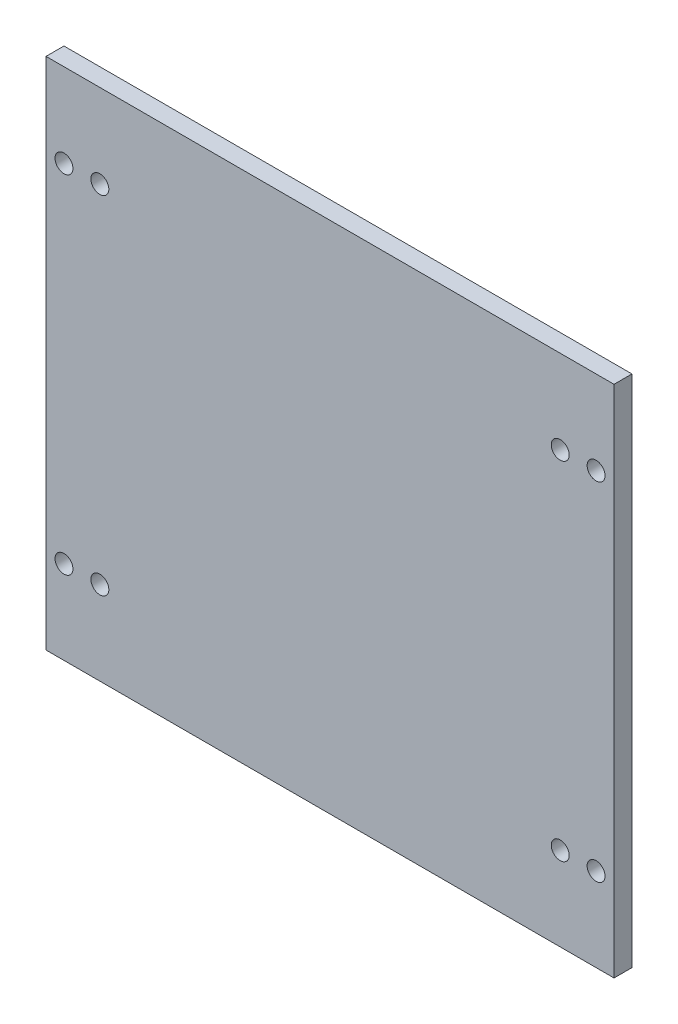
ISO-10303-21;
HEADER;
FILE_DESCRIPTION(('STEP AP214'),'2;1');
FILE_NAME('part.step','',(''),(''),'','','');
FILE_SCHEMA(('AUTOMOTIVE_DESIGN { 1 0 10303 214 1 1 1 1 }'));
ENDSEC;
DATA;
#1=APPLICATION_CONTEXT('core data for automotive mechanical design processes');
#2=APPLICATION_PROTOCOL_DEFINITION('international standard','automotive_design',2000,#1);
#3=PRODUCT_CONTEXT('',#1,'mechanical');
#4=PRODUCT('Part','Part','',(#3));
#5=PRODUCT_RELATED_PRODUCT_CATEGORY('part','',(#4));
#6=PRODUCT_DEFINITION_FORMATION('','',#4);
#7=PRODUCT_DEFINITION_CONTEXT('part definition',#1,'design');
#8=PRODUCT_DEFINITION('design','',#6,#7);
#9=PRODUCT_DEFINITION_SHAPE('','',#8);
#10=(LENGTH_UNIT() NAMED_UNIT(*) SI_UNIT(.MILLI.,.METRE.));
#11=(NAMED_UNIT(*) PLANE_ANGLE_UNIT() SI_UNIT($,.RADIAN.));
#12=(NAMED_UNIT(*) SI_UNIT($,.STERADIAN.) SOLID_ANGLE_UNIT());
#13=UNCERTAINTY_MEASURE_WITH_UNIT(LENGTH_MEASURE(1.E-05),#10,'distance_accuracy_value','');
#14=(GEOMETRIC_REPRESENTATION_CONTEXT(3) GLOBAL_UNCERTAINTY_ASSIGNED_CONTEXT((#13)) GLOBAL_UNIT_ASSIGNED_CONTEXT((#10,
#11,#12)) REPRESENTATION_CONTEXT('',''));
#15=CARTESIAN_POINT('',(0.,0.,0.));
#16=DIRECTION('',(0.,0.,1.));
#17=DIRECTION('',(1.,0.,0.));
#18=AXIS2_PLACEMENT_3D('',#15,#16,#17);
#19=CARTESIAN_POINT('',(0.,86.,3.));
#20=DIRECTION('',(0.,0.,-1.));
#21=DIRECTION('',(-1.,0.,0.));
#22=AXIS2_PLACEMENT_3D('',#19,#20,#21);
#23=PLANE('',#22);
#24=CARTESIAN_POINT('',(92.,14.,3.));
#25=DIRECTION('',(0.,0.,1.));
#26=DIRECTION('',(-1.,0.,0.));
#27=AXIS2_PLACEMENT_3D('',#24,#25,#26);
#28=CIRCLE('',#27,1.5);
#29=CARTESIAN_POINT('',(90.5,14.,3.));
#30=VERTEX_POINT('',#29);
#31=EDGE_CURVE('E131',#30,#30,#28,.T.);
#32=ORIENTED_EDGE('',*,*,#31,.F.);
#33=EDGE_LOOP('',(#32));
#34=FACE_BOUND('',#33,.T.);
#35=CARTESIAN_POINT('',(92.,72.,3.));
#36=DIRECTION('',(0.,0.,1.));
#37=DIRECTION('',(1.,0.,0.));
#38=AXIS2_PLACEMENT_3D('',#35,#36,#37);
#39=CIRCLE('',#38,1.49999999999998);
#40=CARTESIAN_POINT('',(93.5,72.,3.));
#41=VERTEX_POINT('',#40);
#42=EDGE_CURVE('E145',#41,#41,#39,.T.);
#43=ORIENTED_EDGE('',*,*,#42,.F.);
#44=EDGE_LOOP('',(#43));
#45=FACE_BOUND('',#44,.T.);
#46=CARTESIAN_POINT('',(9.,72.,3.));
#47=DIRECTION('',(0.,0.,1.));
#48=DIRECTION('',(-1.,0.,0.));
#49=AXIS2_PLACEMENT_3D('',#46,#47,#48);
#50=CIRCLE('',#49,1.5);
#51=CARTESIAN_POINT('',(7.5,72.,3.));
#52=VERTEX_POINT('',#51);
#53=EDGE_CURVE('E155',#52,#52,#50,.T.);
#54=ORIENTED_EDGE('',*,*,#53,.F.);
#55=EDGE_LOOP('',(#54));
#56=FACE_BOUND('',#55,.T.);
#57=CARTESIAN_POINT('',(3.,14.,3.));
#58=DIRECTION('',(0.,0.,1.));
#59=DIRECTION('',(1.,0.,0.));
#60=AXIS2_PLACEMENT_3D('',#57,#58,#59);
#61=CIRCLE('',#60,1.5);
#62=CARTESIAN_POINT('',(4.5,14.,3.));
#63=VERTEX_POINT('',#62);
#64=EDGE_CURVE('E85',#63,#63,#61,.T.);
#65=ORIENTED_EDGE('',*,*,#64,.F.);
#66=EDGE_LOOP('',(#65));
#67=FACE_BOUND('',#66,.T.);
#68=DIRECTION('',(0.,-1.,0.));
#69=VECTOR('',#68,1.);
#70=CARTESIAN_POINT('',(0.,0.,3.));
#71=LINE('',#70,#69);
#72=CARTESIAN_POINT('',(0.,86.,3.));
#73=VERTEX_POINT('',#72);
#74=CARTESIAN_POINT('',(0.,0.,3.));
#75=VERTEX_POINT('',#74);
#76=EDGE_CURVE('E95',#73,#75,#71,.T.);
#77=ORIENTED_EDGE('',*,*,#76,.T.);
#78=DIRECTION('',(1.,0.,0.));
#79=VECTOR('',#78,1.);
#80=CARTESIAN_POINT('',(0.,0.,3.));
#81=LINE('',#80,#79);
#82=CARTESIAN_POINT('',(95.,0.,3.));
#83=VERTEX_POINT('',#82);
#84=EDGE_CURVE('E80',#75,#83,#81,.T.);
#85=ORIENTED_EDGE('',*,*,#84,.T.);
#86=DIRECTION('',(0.,1.,0.));
#87=VECTOR('',#86,1.);
#88=CARTESIAN_POINT('',(95.,0.,3.));
#89=LINE('',#88,#87);
#90=CARTESIAN_POINT('',(95.,86.,3.));
#91=VERTEX_POINT('',#90);
#92=EDGE_CURVE('E46',#83,#91,#89,.T.);
#93=ORIENTED_EDGE('',*,*,#92,.T.);
#94=DIRECTION('',(-1.,0.,0.));
#95=VECTOR('',#94,1.);
#96=CARTESIAN_POINT('',(0.,86.,3.));
#97=LINE('',#96,#95);
#98=EDGE_CURVE('E41',#91,#73,#97,.T.);
#99=ORIENTED_EDGE('',*,*,#98,.T.);
#100=EDGE_LOOP('',(#77,#85,#93,#99));
#101=FACE_BOUND('',#100,.T.);
#102=CARTESIAN_POINT('',(9.00000000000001,14.,3.));
#103=DIRECTION('',(0.,0.,1.));
#104=DIRECTION('',(1.,0.,0.));
#105=AXIS2_PLACEMENT_3D('',#102,#103,#104);
#106=CIRCLE('',#105,1.5);
#107=CARTESIAN_POINT('',(10.5,14.,3.));
#108=VERTEX_POINT('',#107);
#109=EDGE_CURVE('E114',#108,#108,#106,.T.);
#110=ORIENTED_EDGE('',*,*,#109,.F.);
#111=EDGE_LOOP('',(#110));
#112=FACE_BOUND('',#111,.T.);
#113=CARTESIAN_POINT('',(2.99999999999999,72.,3.));
#114=DIRECTION('',(0.,0.,1.));
#115=DIRECTION('',(-1.,0.,0.));
#116=AXIS2_PLACEMENT_3D('',#113,#114,#115);
#117=CIRCLE('',#116,1.5);
#118=CARTESIAN_POINT('',(1.49999999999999,72.,3.));
#119=VERTEX_POINT('',#118);
#120=EDGE_CURVE('E118',#119,#119,#117,.T.);
#121=ORIENTED_EDGE('',*,*,#120,.F.);
#122=EDGE_LOOP('',(#121));
#123=FACE_BOUND('',#122,.T.);
#124=CARTESIAN_POINT('',(86.,72.,3.));
#125=DIRECTION('',(0.,0.,1.));
#126=DIRECTION('',(1.,0.,0.));
#127=AXIS2_PLACEMENT_3D('',#124,#125,#126);
#128=CIRCLE('',#127,1.5);
#129=CARTESIAN_POINT('',(87.5,72.,3.));
#130=VERTEX_POINT('',#129);
#131=EDGE_CURVE('E122',#130,#130,#128,.T.);
#132=ORIENTED_EDGE('',*,*,#131,.F.);
#133=EDGE_LOOP('',(#132));
#134=FACE_BOUND('',#133,.T.);
#135=CARTESIAN_POINT('',(86.,14.,3.));
#136=DIRECTION('',(0.,0.,1.));
#137=DIRECTION('',(-1.,0.,0.));
#138=AXIS2_PLACEMENT_3D('',#135,#136,#137);
#139=CIRCLE('',#138,1.5);
#140=CARTESIAN_POINT('',(84.5,14.,3.));
#141=VERTEX_POINT('',#140);
#142=EDGE_CURVE('E125',#141,#141,#139,.T.);
#143=ORIENTED_EDGE('',*,*,#142,.F.);
#144=EDGE_LOOP('',(#143));
#145=FACE_BOUND('',#144,.T.);
#146=ADVANCED_FACE('F26',(#34,#45,#56,#67,#101,#112,#123,#134,#145),#23,.F.);
#147=CARTESIAN_POINT('',(0.,86.,0.));
#148=DIRECTION('',(0.,0.,-1.));
#149=DIRECTION('',(-1.,0.,0.));
#150=AXIS2_PLACEMENT_3D('',#147,#148,#149);
#151=PLANE('',#150);
#152=CARTESIAN_POINT('',(92.,14.,0.));
#153=DIRECTION('',(0.,0.,1.));
#154=DIRECTION('',(-1.,0.,0.));
#155=AXIS2_PLACEMENT_3D('',#152,#153,#154);
#156=CIRCLE('',#155,1.5);
#157=CARTESIAN_POINT('',(90.5,14.,0.));
#158=VERTEX_POINT('',#157);
#159=EDGE_CURVE('E127',#158,#158,#156,.T.);
#160=ORIENTED_EDGE('',*,*,#159,.T.);
#161=EDGE_LOOP('',(#160));
#162=FACE_BOUND('',#161,.T.);
#163=CARTESIAN_POINT('',(92.,72.,0.));
#164=DIRECTION('',(0.,0.,1.));
#165=DIRECTION('',(1.,0.,0.));
#166=AXIS2_PLACEMENT_3D('',#163,#164,#165);
#167=CIRCLE('',#166,1.49999999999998);
#168=CARTESIAN_POINT('',(93.5,72.,0.));
#169=VERTEX_POINT('',#168);
#170=EDGE_CURVE('E142',#169,#169,#167,.T.);
#171=ORIENTED_EDGE('',*,*,#170,.T.);
#172=EDGE_LOOP('',(#171));
#173=FACE_BOUND('',#172,.T.);
#174=CARTESIAN_POINT('',(9.,72.,0.));
#175=DIRECTION('',(0.,0.,1.));
#176=DIRECTION('',(-1.,0.,0.));
#177=AXIS2_PLACEMENT_3D('',#174,#175,#176);
#178=CIRCLE('',#177,1.5);
#179=CARTESIAN_POINT('',(7.5,72.,0.));
#180=VERTEX_POINT('',#179);
#181=EDGE_CURVE('E152',#180,#180,#178,.T.);
#182=ORIENTED_EDGE('',*,*,#181,.T.);
#183=EDGE_LOOP('',(#182));
#184=FACE_BOUND('',#183,.T.);
#185=CARTESIAN_POINT('',(3.,14.,0.));
#186=DIRECTION('',(0.,0.,1.));
#187=DIRECTION('',(1.,0.,0.));
#188=AXIS2_PLACEMENT_3D('',#185,#186,#187);
#189=CIRCLE('',#188,1.5);
#190=CARTESIAN_POINT('',(4.5,14.,0.));
#191=VERTEX_POINT('',#190);
#192=EDGE_CURVE('E88',#191,#191,#189,.T.);
#193=ORIENTED_EDGE('',*,*,#192,.T.);
#194=EDGE_LOOP('',(#193));
#195=FACE_BOUND('',#194,.T.);
#196=DIRECTION('',(0.,-1.,0.));
#197=VECTOR('',#196,1.);
#198=CARTESIAN_POINT('',(0.,0.,0.));
#199=LINE('',#198,#197);
#200=CARTESIAN_POINT('',(0.,86.,0.));
#201=VERTEX_POINT('',#200);
#202=CARTESIAN_POINT('',(0.,0.,0.));
#203=VERTEX_POINT('',#202);
#204=EDGE_CURVE('E72',#201,#203,#199,.T.);
#205=ORIENTED_EDGE('',*,*,#204,.F.);
#206=DIRECTION('',(-1.,0.,0.));
#207=VECTOR('',#206,1.);
#208=CARTESIAN_POINT('',(0.,86.,0.));
#209=LINE('',#208,#207);
#210=CARTESIAN_POINT('',(95.,86.,0.));
#211=VERTEX_POINT('',#210);
#212=EDGE_CURVE('E93',#211,#201,#209,.T.);
#213=ORIENTED_EDGE('',*,*,#212,.F.);
#214=DIRECTION('',(0.,1.,0.));
#215=VECTOR('',#214,1.);
#216=CARTESIAN_POINT('',(95.,0.,0.));
#217=LINE('',#216,#215);
#218=CARTESIAN_POINT('',(95.,0.,0.));
#219=VERTEX_POINT('',#218);
#220=EDGE_CURVE('E73',#219,#211,#217,.T.);
#221=ORIENTED_EDGE('',*,*,#220,.F.);
#222=DIRECTION('',(1.,0.,0.));
#223=VECTOR('',#222,1.);
#224=CARTESIAN_POINT('',(0.,0.,0.));
#225=LINE('',#224,#223);
#226=EDGE_CURVE('E67',#203,#219,#225,.T.);
#227=ORIENTED_EDGE('',*,*,#226,.F.);
#228=EDGE_LOOP('',(#205,#213,#221,#227));
#229=FACE_BOUND('',#228,.T.);
#230=CARTESIAN_POINT('',(9.00000000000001,14.,0.));
#231=DIRECTION('',(0.,0.,1.));
#232=DIRECTION('',(1.,0.,0.));
#233=AXIS2_PLACEMENT_3D('',#230,#231,#232);
#234=CIRCLE('',#233,1.5);
#235=CARTESIAN_POINT('',(10.5,14.,0.));
#236=VERTEX_POINT('',#235);
#237=EDGE_CURVE('E158',#236,#236,#234,.T.);
#238=ORIENTED_EDGE('',*,*,#237,.T.);
#239=EDGE_LOOP('',(#238));
#240=FACE_BOUND('',#239,.T.);
#241=CARTESIAN_POINT('',(2.99999999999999,72.,0.));
#242=DIRECTION('',(0.,0.,1.));
#243=DIRECTION('',(-1.,0.,0.));
#244=AXIS2_PLACEMENT_3D('',#241,#242,#243);
#245=CIRCLE('',#244,1.5);
#246=CARTESIAN_POINT('',(1.49999999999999,72.,0.));
#247=VERTEX_POINT('',#246);
#248=EDGE_CURVE('E148',#247,#247,#245,.T.);
#249=ORIENTED_EDGE('',*,*,#248,.T.);
#250=EDGE_LOOP('',(#249));
#251=FACE_BOUND('',#250,.T.);
#252=CARTESIAN_POINT('',(86.,72.,0.));
#253=DIRECTION('',(0.,0.,1.));
#254=DIRECTION('',(1.,0.,0.));
#255=AXIS2_PLACEMENT_3D('',#252,#253,#254);
#256=CIRCLE('',#255,1.5);
#257=CARTESIAN_POINT('',(87.5,72.,0.));
#258=VERTEX_POINT('',#257);
#259=EDGE_CURVE('E138',#258,#258,#256,.T.);
#260=ORIENTED_EDGE('',*,*,#259,.T.);
#261=EDGE_LOOP('',(#260));
#262=FACE_BOUND('',#261,.T.);
#263=CARTESIAN_POINT('',(86.,14.,0.));
#264=DIRECTION('',(0.,0.,1.));
#265=DIRECTION('',(-1.,0.,0.));
#266=AXIS2_PLACEMENT_3D('',#263,#264,#265);
#267=CIRCLE('',#266,1.5);
#268=CARTESIAN_POINT('',(84.5,14.,0.));
#269=VERTEX_POINT('',#268);
#270=EDGE_CURVE('E128',#269,#269,#267,.T.);
#271=ORIENTED_EDGE('',*,*,#270,.T.);
#272=EDGE_LOOP('',(#271));
#273=FACE_BOUND('',#272,.T.);
#274=ADVANCED_FACE('F68',(#162,#173,#184,#195,#229,#240,#251,#262,#273),#151,.T.);
#275=CARTESIAN_POINT('',(0.,0.,3.));
#276=DIRECTION('',(1.,0.,0.));
#277=DIRECTION('',(0.,0.,-1.));
#278=AXIS2_PLACEMENT_3D('',#275,#276,#277);
#279=PLANE('',#278);
#280=ORIENTED_EDGE('',*,*,#204,.T.);
#281=DIRECTION('',(0.,0.,-1.));
#282=VECTOR('',#281,1.);
#283=CARTESIAN_POINT('',(0.,0.,3.));
#284=LINE('',#283,#282);
#285=EDGE_CURVE('E11',#75,#203,#284,.T.);
#286=ORIENTED_EDGE('',*,*,#285,.F.);
#287=ORIENTED_EDGE('',*,*,#76,.F.);
#288=DIRECTION('',(0.,0.,-1.));
#289=VECTOR('',#288,1.);
#290=CARTESIAN_POINT('',(0.,86.,3.));
#291=LINE('',#290,#289);
#292=EDGE_CURVE('E84',#73,#201,#291,.T.);
#293=ORIENTED_EDGE('',*,*,#292,.T.);
#294=EDGE_LOOP('',(#280,#286,#287,#293));
#295=FACE_BOUND('',#294,.T.);
#296=ADVANCED_FACE('F28',(#295),#279,.F.);
#297=CARTESIAN_POINT('',(0.,0.,3.));
#298=DIRECTION('',(0.,1.,0.));
#299=DIRECTION('',(0.,0.,1.));
#300=AXIS2_PLACEMENT_3D('',#297,#298,#299);
#301=PLANE('',#300);
#302=ORIENTED_EDGE('',*,*,#226,.T.);
#303=DIRECTION('',(0.,0.,-1.));
#304=VECTOR('',#303,1.);
#305=CARTESIAN_POINT('',(95.,0.,3.));
#306=LINE('',#305,#304);
#307=EDGE_CURVE('E34',#83,#219,#306,.T.);
#308=ORIENTED_EDGE('',*,*,#307,.F.);
#309=ORIENTED_EDGE('',*,*,#84,.F.);
#310=ORIENTED_EDGE('',*,*,#285,.T.);
#311=EDGE_LOOP('',(#302,#308,#309,#310));
#312=FACE_BOUND('',#311,.T.);
#313=ADVANCED_FACE('F79',(#312),#301,.F.);
#314=CARTESIAN_POINT('',(95.,0.,3.));
#315=DIRECTION('',(-1.,0.,0.));
#316=DIRECTION('',(0.,0.,1.));
#317=AXIS2_PLACEMENT_3D('',#314,#315,#316);
#318=PLANE('',#317);
#319=ORIENTED_EDGE('',*,*,#220,.T.);
#320=DIRECTION('',(0.,0.,-1.));
#321=VECTOR('',#320,1.);
#322=CARTESIAN_POINT('',(95.,86.,3.));
#323=LINE('',#322,#321);
#324=EDGE_CURVE('E101',#91,#211,#323,.T.);
#325=ORIENTED_EDGE('',*,*,#324,.F.);
#326=ORIENTED_EDGE('',*,*,#92,.F.);
#327=ORIENTED_EDGE('',*,*,#307,.T.);
#328=EDGE_LOOP('',(#319,#325,#326,#327));
#329=FACE_BOUND('',#328,.T.);
#330=ADVANCED_FACE('F104',(#329),#318,.F.);
#331=CARTESIAN_POINT('',(0.,86.,3.));
#332=DIRECTION('',(0.,-1.,0.));
#333=DIRECTION('',(0.,0.,-1.));
#334=AXIS2_PLACEMENT_3D('',#331,#332,#333);
#335=PLANE('',#334);
#336=ORIENTED_EDGE('',*,*,#212,.T.);
#337=ORIENTED_EDGE('',*,*,#292,.F.);
#338=ORIENTED_EDGE('',*,*,#98,.F.);
#339=ORIENTED_EDGE('',*,*,#324,.T.);
#340=EDGE_LOOP('',(#336,#337,#338,#339));
#341=FACE_BOUND('',#340,.T.);
#342=ADVANCED_FACE('F106',(#341),#335,.F.);
#343=CARTESIAN_POINT('',(3.,14.,3.));
#344=DIRECTION('',(0.,0.,-1.));
#345=DIRECTION('',(-1.,0.,0.));
#346=AXIS2_PLACEMENT_3D('',#343,#344,#345);
#347=CYLINDRICAL_SURFACE('',#346,1.5);
#348=ORIENTED_EDGE('',*,*,#64,.T.);
#349=EDGE_LOOP('',(#348));
#350=FACE_BOUND('',#349,.T.);
#351=ORIENTED_EDGE('',*,*,#192,.F.);
#352=EDGE_LOOP('',(#351));
#353=FACE_BOUND('',#352,.T.);
#354=ADVANCED_FACE('F165',(#350,#353),#347,.F.);
#355=CARTESIAN_POINT('',(9.00000000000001,14.,3.));
#356=DIRECTION('',(0.,0.,-1.));
#357=DIRECTION('',(-1.,0.,0.));
#358=AXIS2_PLACEMENT_3D('',#355,#356,#357);
#359=CYLINDRICAL_SURFACE('',#358,1.5);
#360=ORIENTED_EDGE('',*,*,#109,.T.);
#361=EDGE_LOOP('',(#360));
#362=FACE_BOUND('',#361,.T.);
#363=ORIENTED_EDGE('',*,*,#237,.F.);
#364=EDGE_LOOP('',(#363));
#365=FACE_BOUND('',#364,.T.);
#366=ADVANCED_FACE('F167',(#362,#365),#359,.F.);
#367=CARTESIAN_POINT('',(9.,72.,3.));
#368=DIRECTION('',(0.,0.,-1.));
#369=DIRECTION('',(-1.,0.,0.));
#370=AXIS2_PLACEMENT_3D('',#367,#368,#369);
#371=CYLINDRICAL_SURFACE('',#370,1.5);
#372=ORIENTED_EDGE('',*,*,#53,.T.);
#373=EDGE_LOOP('',(#372));
#374=FACE_BOUND('',#373,.T.);
#375=ORIENTED_EDGE('',*,*,#181,.F.);
#376=EDGE_LOOP('',(#375));
#377=FACE_BOUND('',#376,.T.);
#378=ADVANCED_FACE('F174',(#374,#377),#371,.F.);
#379=CARTESIAN_POINT('',(2.99999999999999,72.,3.));
#380=DIRECTION('',(0.,0.,-1.));
#381=DIRECTION('',(-1.,0.,0.));
#382=AXIS2_PLACEMENT_3D('',#379,#380,#381);
#383=CYLINDRICAL_SURFACE('',#382,1.5);
#384=ORIENTED_EDGE('',*,*,#120,.T.);
#385=EDGE_LOOP('',(#384));
#386=FACE_BOUND('',#385,.T.);
#387=ORIENTED_EDGE('',*,*,#248,.F.);
#388=EDGE_LOOP('',(#387));
#389=FACE_BOUND('',#388,.T.);
#390=ADVANCED_FACE('F221',(#386,#389),#383,.F.);
#391=CARTESIAN_POINT('',(92.,72.,3.));
#392=DIRECTION('',(0.,0.,-1.));
#393=DIRECTION('',(-1.,0.,0.));
#394=AXIS2_PLACEMENT_3D('',#391,#392,#393);
#395=CYLINDRICAL_SURFACE('',#394,1.49999999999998);
#396=ORIENTED_EDGE('',*,*,#42,.T.);
#397=EDGE_LOOP('',(#396));
#398=FACE_BOUND('',#397,.T.);
#399=ORIENTED_EDGE('',*,*,#170,.F.);
#400=EDGE_LOOP('',(#399));
#401=FACE_BOUND('',#400,.T.);
#402=ADVANCED_FACE('F228',(#398,#401),#395,.F.);
#403=CARTESIAN_POINT('',(86.,72.,3.));
#404=DIRECTION('',(0.,0.,-1.));
#405=DIRECTION('',(-1.,0.,0.));
#406=AXIS2_PLACEMENT_3D('',#403,#404,#405);
#407=CYLINDRICAL_SURFACE('',#406,1.5);
#408=ORIENTED_EDGE('',*,*,#131,.T.);
#409=EDGE_LOOP('',(#408));
#410=FACE_BOUND('',#409,.T.);
#411=ORIENTED_EDGE('',*,*,#259,.F.);
#412=EDGE_LOOP('',(#411));
#413=FACE_BOUND('',#412,.T.);
#414=ADVANCED_FACE('F236',(#410,#413),#407,.F.);
#415=CARTESIAN_POINT('',(92.,14.,3.));
#416=DIRECTION('',(0.,0.,-1.));
#417=DIRECTION('',(-1.,0.,0.));
#418=AXIS2_PLACEMENT_3D('',#415,#416,#417);
#419=CYLINDRICAL_SURFACE('',#418,1.5);
#420=ORIENTED_EDGE('',*,*,#31,.T.);
#421=EDGE_LOOP('',(#420));
#422=FACE_BOUND('',#421,.T.);
#423=ORIENTED_EDGE('',*,*,#159,.F.);
#424=EDGE_LOOP('',(#423));
#425=FACE_BOUND('',#424,.T.);
#426=ADVANCED_FACE('F244',(#422,#425),#419,.F.);
#427=CARTESIAN_POINT('',(86.,14.,3.));
#428=DIRECTION('',(0.,0.,-1.));
#429=DIRECTION('',(-1.,0.,0.));
#430=AXIS2_PLACEMENT_3D('',#427,#428,#429);
#431=CYLINDRICAL_SURFACE('',#430,1.5);
#432=ORIENTED_EDGE('',*,*,#142,.T.);
#433=EDGE_LOOP('',(#432));
#434=FACE_BOUND('',#433,.T.);
#435=ORIENTED_EDGE('',*,*,#270,.F.);
#436=EDGE_LOOP('',(#435));
#437=FACE_BOUND('',#436,.T.);
#438=ADVANCED_FACE('F252',(#434,#437),#431,.F.);
#439=CLOSED_SHELL('',(#146,#274,#296,#313,#330,#342,#354,#366,#378,#390,#402,#414,#426,#438));
#440=MANIFOLD_SOLID_BREP('B2',#439);
#441=ADVANCED_BREP_SHAPE_REPRESENTATION('',(#18,#440),#14);
#442=SHAPE_DEFINITION_REPRESENTATION(#9,#441);
ENDSEC;
END-ISO-10303-21;
